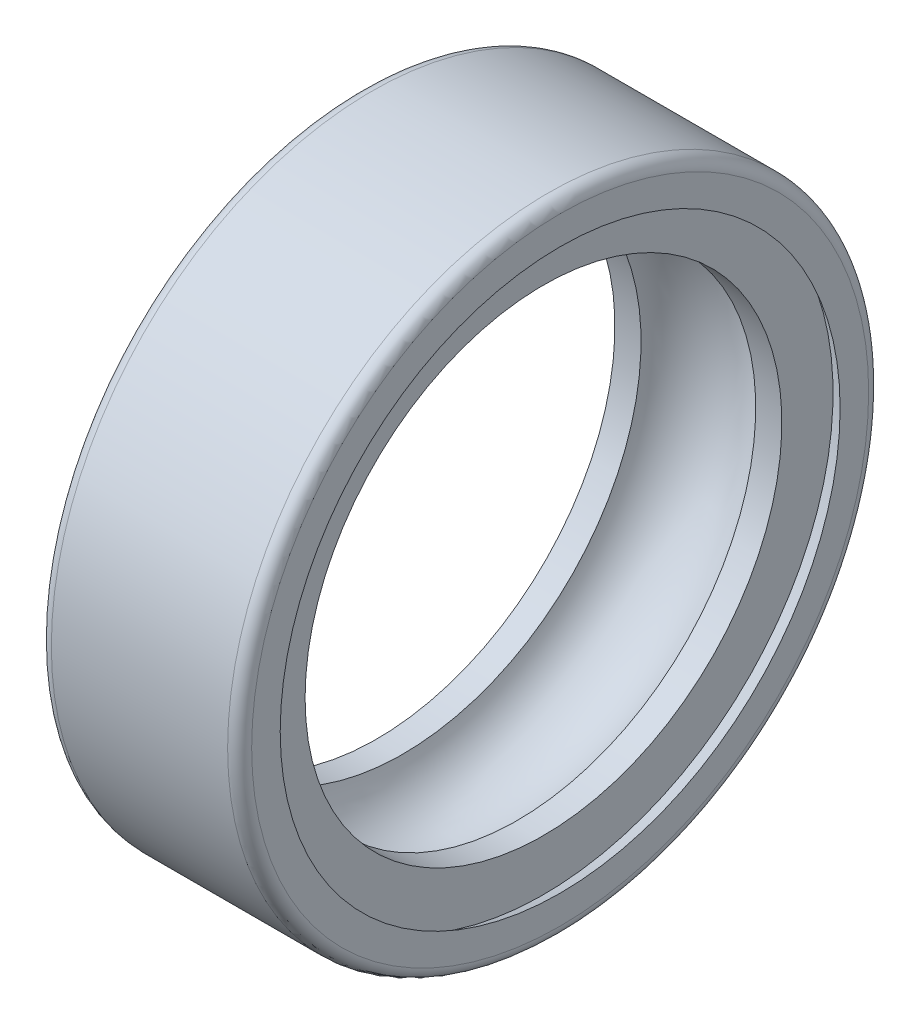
ISO-10303-21;
HEADER;
FILE_DESCRIPTION(('STEP AP214'),'2;1');
FILE_NAME('part.step','',(''),(''),'','','');
FILE_SCHEMA(('AUTOMOTIVE_DESIGN { 1 0 10303 214 1 1 1 1 }'));
ENDSEC;
DATA;
#1=APPLICATION_CONTEXT('core data for automotive mechanical design processes');
#2=APPLICATION_PROTOCOL_DEFINITION('international standard','automotive_design',2000,#1);
#3=PRODUCT_CONTEXT('',#1,'mechanical');
#4=PRODUCT('Part','Part','',(#3));
#5=PRODUCT_RELATED_PRODUCT_CATEGORY('part','',(#4));
#6=PRODUCT_DEFINITION_FORMATION('','',#4);
#7=PRODUCT_DEFINITION_CONTEXT('part definition',#1,'design');
#8=PRODUCT_DEFINITION('design','',#6,#7);
#9=PRODUCT_DEFINITION_SHAPE('','',#8);
#10=(LENGTH_UNIT() NAMED_UNIT(*) SI_UNIT(.MILLI.,.METRE.));
#11=(NAMED_UNIT(*) PLANE_ANGLE_UNIT() SI_UNIT($,.RADIAN.));
#12=(NAMED_UNIT(*) SI_UNIT($,.STERADIAN.) SOLID_ANGLE_UNIT());
#13=UNCERTAINTY_MEASURE_WITH_UNIT(LENGTH_MEASURE(1.E-05),#10,'distance_accuracy_value','');
#14=(GEOMETRIC_REPRESENTATION_CONTEXT(3) GLOBAL_UNCERTAINTY_ASSIGNED_CONTEXT((#13)) GLOBAL_UNIT_ASSIGNED_CONTEXT((#10,
#11,#12)) REPRESENTATION_CONTEXT('',''));
#15=CARTESIAN_POINT('',(0.,0.,0.));
#16=DIRECTION('',(0.,0.,1.));
#17=DIRECTION('',(1.,0.,0.));
#18=AXIS2_PLACEMENT_3D('',#15,#16,#17);
#19=CARTESIAN_POINT('',(0.,0.,0.));
#20=DIRECTION('',(-1.,0.,0.));
#21=DIRECTION('',(0.,0.,1.));
#22=AXIS2_PLACEMENT_3D('',#19,#20,#21);
#23=CYLINDRICAL_SURFACE('',#22,11.9);
#24=CARTESIAN_POINT('',(9.16666666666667,0.,0.));
#25=DIRECTION('',(-1.,0.,0.));
#26=DIRECTION('',(0.,0.,1.));
#27=AXIS2_PLACEMENT_3D('',#24,#25,#26);
#28=CIRCLE('',#27,11.9);
#29=CARTESIAN_POINT('',(9.16666666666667,0.,11.9));
#30=VERTEX_POINT('',#29);
#31=EDGE_CURVE('E10',#30,#30,#28,.T.);
#32=ORIENTED_EDGE('',*,*,#31,.F.);
#33=EDGE_LOOP('',(#32));
#34=FACE_BOUND('',#33,.T.);
#35=CARTESIAN_POINT('',(7.86181760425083,0.,0.));
#36=DIRECTION('',(-1.,0.,0.));
#37=DIRECTION('',(0.,0.,1.));
#38=AXIS2_PLACEMENT_3D('',#35,#36,#37);
#39=CIRCLE('',#38,11.9);
#40=CARTESIAN_POINT('',(7.86181760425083,0.,11.9));
#41=VERTEX_POINT('',#40);
#42=EDGE_CURVE('E72',#41,#41,#39,.T.);
#43=ORIENTED_EDGE('',*,*,#42,.T.);
#44=EDGE_LOOP('',(#43));
#45=FACE_BOUND('',#44,.T.);
#46=ADVANCED_FACE('F14',(#34,#45),#23,.F.);
#47=CARTESIAN_POINT('',(9.16666666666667,11.9,0.));
#48=DIRECTION('',(-1.,0.,0.));
#49=DIRECTION('',(0.,0.,1.));
#50=AXIS2_PLACEMENT_3D('',#47,#48,#49);
#51=PLANE('',#50);
#52=CARTESIAN_POINT('',(9.16666666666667,0.,0.));
#53=DIRECTION('',(-1.,0.,0.));
#54=DIRECTION('',(0.,0.,1.));
#55=AXIS2_PLACEMENT_3D('',#52,#53,#54);
#56=CIRCLE('',#55,14.4561252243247);
#57=CARTESIAN_POINT('',(9.16666666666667,0.,14.4561252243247));
#58=VERTEX_POINT('',#57);
#59=EDGE_CURVE('E21',#58,#58,#56,.T.);
#60=ORIENTED_EDGE('',*,*,#59,.F.);
#61=EDGE_LOOP('',(#60));
#62=FACE_BOUND('',#61,.T.);
#63=ORIENTED_EDGE('',*,*,#31,.T.);
#64=EDGE_LOOP('',(#63));
#65=FACE_BOUND('',#64,.T.);
#66=ADVANCED_FACE('F91',(#62,#65),#51,.F.);
#67=CARTESIAN_POINT('',(9.16666666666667,0.,0.));
#68=DIRECTION('',(-1.,0.,0.));
#69=DIRECTION('',(0.,0.,1.));
#70=AXIS2_PLACEMENT_3D('',#67,#68,#69);
#71=CONICAL_SURFACE('',#70,14.4561252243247,0.523598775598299);
#72=CARTESIAN_POINT('',(10.,0.,0.));
#73=DIRECTION('',(-1.,0.,0.));
#74=DIRECTION('',(0.,0.,1.));
#75=AXIS2_PLACEMENT_3D('',#72,#73,#74);
#76=CIRCLE('',#75,13.975);
#77=CARTESIAN_POINT('',(10.,0.,13.975));
#78=VERTEX_POINT('',#77);
#79=EDGE_CURVE('E30',#78,#78,#76,.T.);
#80=ORIENTED_EDGE('',*,*,#79,.F.);
#81=EDGE_LOOP('',(#80));
#82=FACE_BOUND('',#81,.T.);
#83=ORIENTED_EDGE('',*,*,#59,.T.);
#84=EDGE_LOOP('',(#83));
#85=FACE_BOUND('',#84,.T.);
#86=ADVANCED_FACE('F96',(#82,#85),#71,.F.);
#87=CARTESIAN_POINT('',(10.,13.975,0.));
#88=DIRECTION('',(-1.,0.,0.));
#89=DIRECTION('',(0.,0.,1.));
#90=AXIS2_PLACEMENT_3D('',#87,#88,#89);
#91=PLANE('',#90);
#92=CARTESIAN_POINT('',(10.,0.,0.));
#93=DIRECTION('',(-1.,0.,0.));
#94=DIRECTION('',(0.,0.,1.));
#95=AXIS2_PLACEMENT_3D('',#92,#93,#94);
#96=CIRCLE('',#95,15.4);
#97=CARTESIAN_POINT('',(10.,0.,15.4));
#98=VERTEX_POINT('',#97);
#99=EDGE_CURVE('E38',#98,#98,#96,.T.);
#100=ORIENTED_EDGE('',*,*,#99,.F.);
#101=EDGE_LOOP('',(#100));
#102=FACE_BOUND('',#101,.T.);
#103=ORIENTED_EDGE('',*,*,#79,.T.);
#104=EDGE_LOOP('',(#103));
#105=FACE_BOUND('',#104,.T.);
#106=ADVANCED_FACE('F101',(#102,#105),#91,.F.);
#107=CARTESIAN_POINT('',(9.4,0.,0.));
#108=DIRECTION('',(-1.,0.,0.));
#109=DIRECTION('',(0.,0.,1.));
#110=AXIS2_PLACEMENT_3D('',#107,#108,#109);
#111=TOROIDAL_SURFACE('',#110,15.4,0.6);
#112=CARTESIAN_POINT('',(9.4,0.,0.));
#113=DIRECTION('',(-1.,0.,0.));
#114=DIRECTION('',(0.,0.,1.));
#115=AXIS2_PLACEMENT_3D('',#112,#113,#114);
#116=CIRCLE('',#115,16.);
#117=CARTESIAN_POINT('',(9.4,0.,16.));
#118=VERTEX_POINT('',#117);
#119=EDGE_CURVE('E44',#118,#118,#116,.T.);
#120=ORIENTED_EDGE('',*,*,#119,.F.);
#121=EDGE_LOOP('',(#120));
#122=FACE_BOUND('',#121,.T.);
#123=ORIENTED_EDGE('',*,*,#99,.T.);
#124=EDGE_LOOP('',(#123));
#125=FACE_BOUND('',#124,.T.);
#126=ADVANCED_FACE('F107',(#122,#125),#111,.T.);
#127=CARTESIAN_POINT('',(0.,0.,0.));
#128=DIRECTION('',(-1.,0.,0.));
#129=DIRECTION('',(0.,0.,1.));
#130=AXIS2_PLACEMENT_3D('',#127,#128,#129);
#131=CYLINDRICAL_SURFACE('',#130,16.);
#132=CARTESIAN_POINT('',(0.6,0.,0.));
#133=DIRECTION('',(-1.,0.,0.));
#134=DIRECTION('',(0.,0.,1.));
#135=AXIS2_PLACEMENT_3D('',#132,#133,#134);
#136=CIRCLE('',#135,16.);
#137=CARTESIAN_POINT('',(0.6,0.,16.));
#138=VERTEX_POINT('',#137);
#139=EDGE_CURVE('E48',#138,#138,#136,.T.);
#140=ORIENTED_EDGE('',*,*,#139,.F.);
#141=EDGE_LOOP('',(#140));
#142=FACE_BOUND('',#141,.T.);
#143=ORIENTED_EDGE('',*,*,#119,.T.);
#144=EDGE_LOOP('',(#143));
#145=FACE_BOUND('',#144,.T.);
#146=ADVANCED_FACE('F111',(#142,#145),#131,.T.);
#147=CARTESIAN_POINT('',(0.6,0.,0.));
#148=DIRECTION('',(-1.,0.,0.));
#149=DIRECTION('',(0.,0.,1.));
#150=AXIS2_PLACEMENT_3D('',#147,#148,#149);
#151=TOROIDAL_SURFACE('',#150,15.4,0.6);
#152=CARTESIAN_POINT('',(0.,0.,0.));
#153=DIRECTION('',(-1.,0.,0.));
#154=DIRECTION('',(0.,0.,1.));
#155=AXIS2_PLACEMENT_3D('',#152,#153,#154);
#156=CIRCLE('',#155,15.4);
#157=CARTESIAN_POINT('',(0.,0.,15.4));
#158=VERTEX_POINT('',#157);
#159=EDGE_CURVE('E52',#158,#158,#156,.T.);
#160=ORIENTED_EDGE('',*,*,#159,.F.);
#161=EDGE_LOOP('',(#160));
#162=FACE_BOUND('',#161,.T.);
#163=ORIENTED_EDGE('',*,*,#139,.T.);
#164=EDGE_LOOP('',(#163));
#165=FACE_BOUND('',#164,.T.);
#166=ADVANCED_FACE('F115',(#162,#165),#151,.T.);
#167=CARTESIAN_POINT('',(0.,15.4,0.));
#168=DIRECTION('',(1.,0.,0.));
#169=DIRECTION('',(0.,0.,-1.));
#170=AXIS2_PLACEMENT_3D('',#167,#168,#169);
#171=PLANE('',#170);
#172=CARTESIAN_POINT('',(0.,0.,0.));
#173=DIRECTION('',(-1.,0.,0.));
#174=DIRECTION('',(0.,0.,1.));
#175=AXIS2_PLACEMENT_3D('',#172,#173,#174);
#176=CIRCLE('',#175,13.975);
#177=CARTESIAN_POINT('',(0.,0.,13.975));
#178=VERTEX_POINT('',#177);
#179=EDGE_CURVE('E56',#178,#178,#176,.T.);
#180=ORIENTED_EDGE('',*,*,#179,.F.);
#181=EDGE_LOOP('',(#180));
#182=FACE_BOUND('',#181,.T.);
#183=ORIENTED_EDGE('',*,*,#159,.T.);
#184=EDGE_LOOP('',(#183));
#185=FACE_BOUND('',#184,.T.);
#186=ADVANCED_FACE('F119',(#182,#185),#171,.F.);
#187=CARTESIAN_POINT('',(0.,0.,0.));
#188=DIRECTION('',(1.,0.,0.));
#189=DIRECTION('',(0.,0.,-1.));
#190=AXIS2_PLACEMENT_3D('',#187,#188,#189);
#191=CONICAL_SURFACE('',#190,13.975,0.523598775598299);
#192=CARTESIAN_POINT('',(0.833333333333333,0.,0.));
#193=DIRECTION('',(-1.,0.,0.));
#194=DIRECTION('',(0.,0.,1.));
#195=AXIS2_PLACEMENT_3D('',#192,#193,#194);
#196=CIRCLE('',#195,14.4561252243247);
#197=CARTESIAN_POINT('',(0.833333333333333,0.,14.4561252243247));
#198=VERTEX_POINT('',#197);
#199=EDGE_CURVE('E60',#198,#198,#196,.T.);
#200=ORIENTED_EDGE('',*,*,#199,.F.);
#201=EDGE_LOOP('',(#200));
#202=FACE_BOUND('',#201,.T.);
#203=ORIENTED_EDGE('',*,*,#179,.T.);
#204=EDGE_LOOP('',(#203));
#205=FACE_BOUND('',#204,.T.);
#206=ADVANCED_FACE('F123',(#202,#205),#191,.F.);
#207=CARTESIAN_POINT('',(0.833333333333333,14.4561252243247,0.));
#208=DIRECTION('',(1.,0.,0.));
#209=DIRECTION('',(0.,0.,-1.));
#210=AXIS2_PLACEMENT_3D('',#207,#208,#209);
#211=PLANE('',#210);
#212=CARTESIAN_POINT('',(0.833333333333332,0.,0.));
#213=DIRECTION('',(-1.,0.,0.));
#214=DIRECTION('',(0.,0.,1.));
#215=AXIS2_PLACEMENT_3D('',#212,#213,#214);
#216=CIRCLE('',#215,11.9);
#217=CARTESIAN_POINT('',(0.833333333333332,0.,11.9));
#218=VERTEX_POINT('',#217);
#219=EDGE_CURVE('E64',#218,#218,#216,.T.);
#220=ORIENTED_EDGE('',*,*,#219,.F.);
#221=EDGE_LOOP('',(#220));
#222=FACE_BOUND('',#221,.T.);
#223=ORIENTED_EDGE('',*,*,#199,.T.);
#224=EDGE_LOOP('',(#223));
#225=FACE_BOUND('',#224,.T.);
#226=ADVANCED_FACE('F87',(#222,#225),#211,.F.);
#227=CARTESIAN_POINT('',(0.,0.,0.));
#228=DIRECTION('',(-1.,0.,0.));
#229=DIRECTION('',(0.,0.,1.));
#230=AXIS2_PLACEMENT_3D('',#227,#228,#229);
#231=CYLINDRICAL_SURFACE('',#230,11.9);
#232=CARTESIAN_POINT('',(2.13818239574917,0.,0.));
#233=DIRECTION('',(-1.,0.,0.));
#234=DIRECTION('',(0.,0.,1.));
#235=AXIS2_PLACEMENT_3D('',#232,#233,#234);
#236=CIRCLE('',#235,11.9);
#237=CARTESIAN_POINT('',(2.13818239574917,0.,11.9));
#238=VERTEX_POINT('',#237);
#239=EDGE_CURVE('E68',#238,#238,#236,.T.);
#240=ORIENTED_EDGE('',*,*,#239,.F.);
#241=EDGE_LOOP('',(#240));
#242=FACE_BOUND('',#241,.T.);
#243=ORIENTED_EDGE('',*,*,#219,.T.);
#244=EDGE_LOOP('',(#243));
#245=FACE_BOUND('',#244,.T.);
#246=ADVANCED_FACE('F80',(#242,#245),#231,.F.);
#247=CARTESIAN_POINT('',(5.,0.,0.));
#248=DIRECTION('',(-1.,0.,0.));
#249=DIRECTION('',(0.,0.,1.));
#250=AXIS2_PLACEMENT_3D('',#247,#248,#249);
#251=TOROIDAL_SURFACE('',#250,11.,3.);
#252=ORIENTED_EDGE('',*,*,#239,.T.);
#253=EDGE_LOOP('',(#252));
#254=FACE_BOUND('',#253,.T.);
#255=ORIENTED_EDGE('',*,*,#42,.F.);
#256=EDGE_LOOP('',(#255));
#257=FACE_BOUND('',#256,.T.);
#258=ADVANCED_FACE('F78',(#254,#257),#251,.F.);
#259=CLOSED_SHELL('',(#46,#66,#86,#106,#126,#146,#166,#186,#206,#226,#246,#258));
#260=MANIFOLD_SOLID_BREP('B1',#259);
#261=ADVANCED_BREP_SHAPE_REPRESENTATION('',(#18,#260),#14);
#262=SHAPE_DEFINITION_REPRESENTATION(#9,#261);
ENDSEC;
END-ISO-10303-21;
